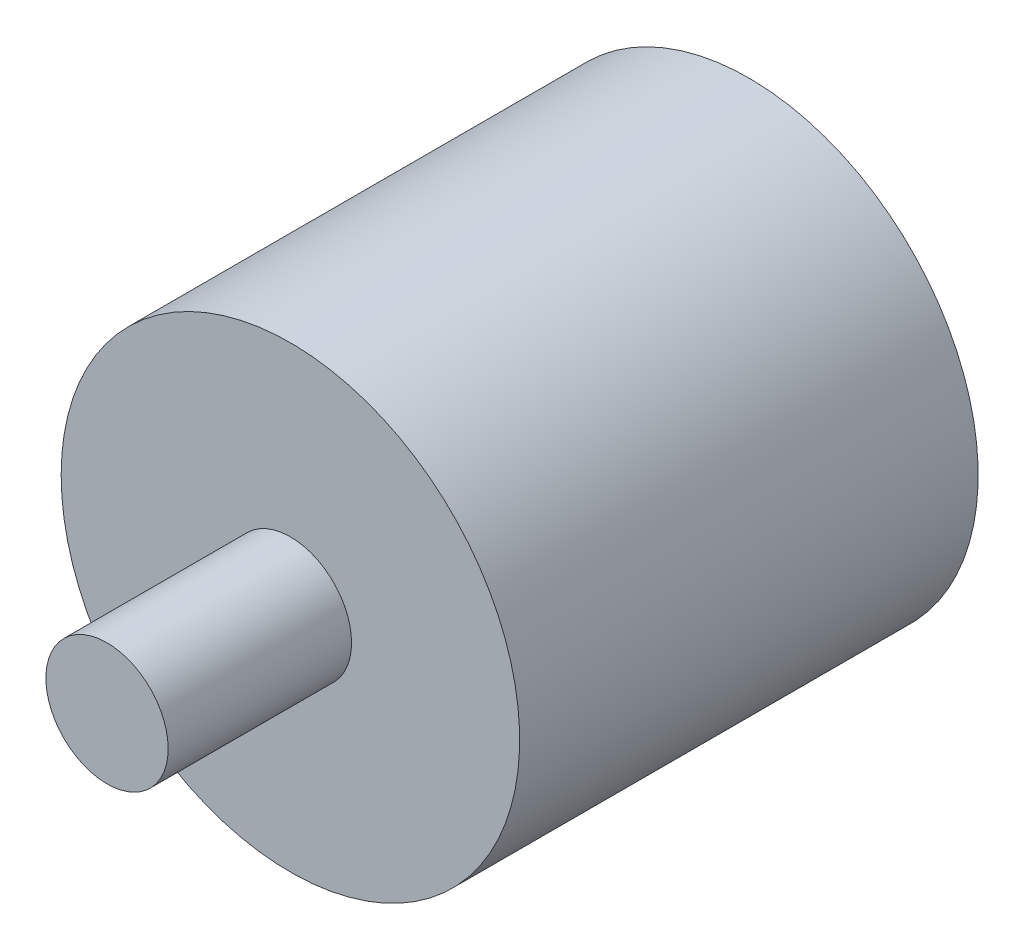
ISO-10303-21;
HEADER;
FILE_DESCRIPTION(('STEP AP214'),'2;1');
FILE_NAME('part.step','',(''),(''),'','','');
FILE_SCHEMA(('AUTOMOTIVE_DESIGN { 1 0 10303 214 1 1 1 1 }'));
ENDSEC;
DATA;
#1=APPLICATION_CONTEXT('core data for automotive mechanical design processes');
#2=APPLICATION_PROTOCOL_DEFINITION('international standard','automotive_design',2000,#1);
#3=PRODUCT_CONTEXT('',#1,'mechanical');
#4=PRODUCT('Part','Part','',(#3));
#5=PRODUCT_RELATED_PRODUCT_CATEGORY('part','',(#4));
#6=PRODUCT_DEFINITION_FORMATION('','',#4);
#7=PRODUCT_DEFINITION_CONTEXT('part definition',#1,'design');
#8=PRODUCT_DEFINITION('design','',#6,#7);
#9=PRODUCT_DEFINITION_SHAPE('','',#8);
#10=(LENGTH_UNIT() NAMED_UNIT(*) SI_UNIT(.MILLI.,.METRE.));
#11=(NAMED_UNIT(*) PLANE_ANGLE_UNIT() SI_UNIT($,.RADIAN.));
#12=(NAMED_UNIT(*) SI_UNIT($,.STERADIAN.) SOLID_ANGLE_UNIT());
#13=UNCERTAINTY_MEASURE_WITH_UNIT(LENGTH_MEASURE(1.E-05),#10,'distance_accuracy_value','');
#14=(GEOMETRIC_REPRESENTATION_CONTEXT(3) GLOBAL_UNCERTAINTY_ASSIGNED_CONTEXT((#13)) GLOBAL_UNIT_ASSIGNED_CONTEXT((#10,
#11,#12)) REPRESENTATION_CONTEXT('',''));
#15=CARTESIAN_POINT('',(0.,0.,0.));
#16=DIRECTION('',(0.,0.,1.));
#17=DIRECTION('',(1.,0.,0.));
#18=AXIS2_PLACEMENT_3D('',#15,#16,#17);
#19=CARTESIAN_POINT('',(0.,0.,12.));
#20=DIRECTION('',(0.,0.,-1.));
#21=DIRECTION('',(-1.,0.,0.));
#22=AXIS2_PLACEMENT_3D('',#19,#20,#21);
#23=PLANE('',#22);
#24=CARTESIAN_POINT('',(0.,0.,12.));
#25=DIRECTION('',(0.,0.,1.));
#26=DIRECTION('',(1.,0.,0.));
#27=AXIS2_PLACEMENT_3D('',#24,#25,#26);
#28=CIRCLE('',#27,4.);
#29=CARTESIAN_POINT('',(4.,0.,12.));
#30=VERTEX_POINT('',#29);
#31=EDGE_CURVE('E16',#30,#30,#28,.F.);
#32=ORIENTED_EDGE('',*,*,#31,.F.);
#33=EDGE_LOOP('',(#32));
#34=FACE_BOUND('',#33,.T.);
#35=ADVANCED_FACE('F13',(#34),#23,.F.);
#36=CARTESIAN_POINT('',(0.,0.,0.));
#37=DIRECTION('',(0.,0.,1.));
#38=DIRECTION('',(1.,0.,0.));
#39=AXIS2_PLACEMENT_3D('',#36,#37,#38);
#40=CYLINDRICAL_SURFACE('',#39,4.);
#41=CARTESIAN_POINT('',(0.,0.,0.));
#42=DIRECTION('',(0.,0.,1.));
#43=DIRECTION('',(1.,0.,0.));
#44=AXIS2_PLACEMENT_3D('',#41,#42,#43);
#45=CIRCLE('',#44,4.);
#46=CARTESIAN_POINT('',(4.,0.,0.));
#47=VERTEX_POINT('',#46);
#48=EDGE_CURVE('E25',#47,#47,#45,.T.);
#49=ORIENTED_EDGE('',*,*,#48,.T.);
#50=EDGE_LOOP('',(#49));
#51=FACE_BOUND('',#50,.T.);
#52=ORIENTED_EDGE('',*,*,#31,.T.);
#53=EDGE_LOOP('',(#52));
#54=FACE_BOUND('',#53,.T.);
#55=ADVANCED_FACE('F33',(#51,#54),#40,.T.);
#56=CARTESIAN_POINT('',(0.,0.,-30.));
#57=DIRECTION('',(0.,0.,-1.));
#58=DIRECTION('',(-1.,0.,0.));
#59=AXIS2_PLACEMENT_3D('',#56,#57,#58);
#60=PLANE('',#59);
#61=CARTESIAN_POINT('',(0.,0.,-30.));
#62=DIRECTION('',(0.,0.,-1.));
#63=DIRECTION('',(-1.,0.,0.));
#64=AXIS2_PLACEMENT_3D('',#61,#62,#63);
#65=CIRCLE('',#64,15.);
#66=CARTESIAN_POINT('',(-15.,0.,-30.));
#67=VERTEX_POINT('',#66);
#68=EDGE_CURVE('E20',#67,#67,#65,.F.);
#69=ORIENTED_EDGE('',*,*,#68,.F.);
#70=EDGE_LOOP('',(#69));
#71=FACE_BOUND('',#70,.T.);
#72=ADVANCED_FACE('F41',(#71),#60,.T.);
#73=CARTESIAN_POINT('',(0.,0.,0.));
#74=DIRECTION('',(0.,0.,-1.));
#75=DIRECTION('',(-1.,0.,0.));
#76=AXIS2_PLACEMENT_3D('',#73,#74,#75);
#77=PLANE('',#76);
#78=ORIENTED_EDGE('',*,*,#48,.F.);
#79=EDGE_LOOP('',(#78));
#80=FACE_BOUND('',#79,.T.);
#81=CARTESIAN_POINT('',(0.,0.,0.));
#82=DIRECTION('',(0.,0.,-1.));
#83=DIRECTION('',(-1.,0.,0.));
#84=AXIS2_PLACEMENT_3D('',#81,#82,#83);
#85=CIRCLE('',#84,15.);
#86=CARTESIAN_POINT('',(-15.,0.,0.));
#87=VERTEX_POINT('',#86);
#88=EDGE_CURVE('E9',#87,#87,#85,.T.);
#89=ORIENTED_EDGE('',*,*,#88,.F.);
#90=EDGE_LOOP('',(#89));
#91=FACE_BOUND('',#90,.T.);
#92=ADVANCED_FACE('F44',(#80,#91),#77,.F.);
#93=CARTESIAN_POINT('',(0.,0.,0.));
#94=DIRECTION('',(0.,0.,-1.));
#95=DIRECTION('',(-1.,0.,0.));
#96=AXIS2_PLACEMENT_3D('',#93,#94,#95);
#97=CYLINDRICAL_SURFACE('',#96,15.);
#98=ORIENTED_EDGE('',*,*,#88,.T.);
#99=EDGE_LOOP('',(#98));
#100=FACE_BOUND('',#99,.T.);
#101=ORIENTED_EDGE('',*,*,#68,.T.);
#102=EDGE_LOOP('',(#101));
#103=FACE_BOUND('',#102,.T.);
#104=ADVANCED_FACE('F42',(#100,#103),#97,.T.);
#105=CLOSED_SHELL('',(#35,#55,#72,#92,#104));
#106=MANIFOLD_SOLID_BREP('B1',#105);
#107=ADVANCED_BREP_SHAPE_REPRESENTATION('',(#18,#106),#14);
#108=SHAPE_DEFINITION_REPRESENTATION(#9,#107);
ENDSEC;
END-ISO-10303-21;
